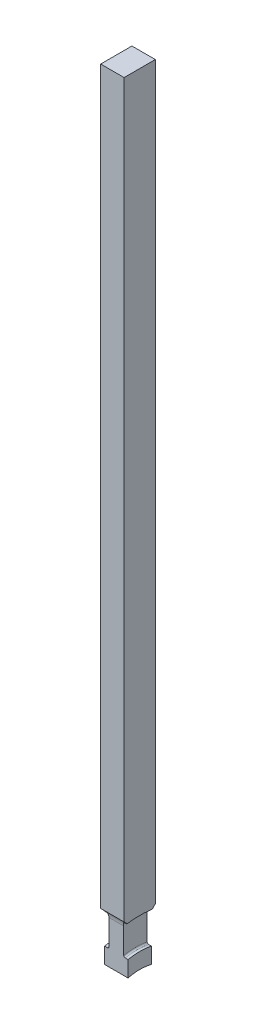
from build123d import *

# Parameters (mm, degrees)
SKETCH1_W               = 8
SKETCH1_H               = 212
BOSS_EXTRUDE1_DEPTH     = 3
CUT_EXTRUDE4_DEPTH      = 213.058954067
CUT_EXTRUDE4_DEPTH_BACK = 213.058954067
SKETCH8_R               = 12
SKETCH2_W               = 1.095
SKETCH2_H               = 8
CUT_EXTRUDE2_DEPTH      = 213.058954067
CUT_EXTRUDE2_DEPTH_BACK = 213.058954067
FILLET1_R               = 0.762
FILLET2_R               = 0.381


with BuildPart() as part:
    # Sketch1 → Boss-Extrude1 (new, symmetric)
    with BuildSketch(Plane(origin=(0, 0, 0), x_dir=(0, 0, -1), z_dir=(1, 0, 0))):
        with Locations((0, 106)):
            Rectangle(SKETCH1_W, SKETCH1_H)
    extrude(amount=BOSS_EXTRUDE1_DEPTH, both=True)

    # Sketch8 → Cut-Extrude4 (cut, two sides: drawn at the far end of the back side and taken through both)
    with BuildSketch(Plane(origin=(0, 0, 0), x_dir=(0, 0, -1), z_dir=(1, 0, 0)).offset(-CUT_EXTRUDE4_DEPTH_BACK)):
        Circle(SKETCH8_R)
    extrude(amount=CUT_EXTRUDE4_DEPTH + CUT_EXTRUDE4_DEPTH_BACK, mode=Mode.SUBTRACT)

    # Sketch2 → Cut-Revolve1 (revolve, cut)
    with BuildSketch(Plane.XY):
        with Locations((2.4525, 20)):
            Rectangle(SKETCH2_W, SKETCH2_H)
        with Locations((-2.4525, 20)):
            Rectangle(SKETCH2_W, SKETCH2_H)
    revolve(axis=Axis((-8.84822894, 0, 0), (1, 0, 0)), mode=Mode.SUBTRACT)

    # Sketch6 → Cut-Extrude2 (cut, two sides: drawn at the far end of the back side and taken through both)
    with BuildSketch(Plane(origin=(0, 0, 0), x_dir=(0, 0, -1), z_dir=(1, 0, 0)).offset(-CUT_EXTRUDE2_DEPTH_BACK)):
        with BuildLine():
            Line((3, 0), (22.05, 0))
            Line((22.05, 0), (22.05, 25))
            Line((22.05, 25), (5.3876, 25))
            ThreePointArc((5.3876, 25), (3.699311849, 24.300688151), (3, 22.6124))
            Line((3, 22.6124), (3, 0))
        make_face()
        with BuildLine():
            Line((-3, 0), (-22.05, 0))
            Line((-22.05, 0), (-22.05, 25))
            Line((-22.05, 25), (-5.3876, 25))
            ThreePointArc((-5.3876, 25), (-3.699311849, 24.300688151), (-3, 22.6124))
            Line((-3, 22.6124), (-3, 0))
        make_face()
    extrude(amount=CUT_EXTRUDE2_DEPTH + CUT_EXTRUDE2_DEPTH_BACK, mode=Mode.SUBTRACT)

    # Fillet1
    fillet1_edges = [part.edges().sort_by_distance(p)[0] for p in [
        (1.905, 24, 0),
        (-1.905, 24, 0),
    ]]
    fillet(fillet1_edges, radius=FILLET1_R)

    # Fillet2
    fillet2_edges = [part.edges().sort_by_distance(p)[0] for p in [
        (1.905, 16, 0),
        (-1.905, 16, 0),
    ]]
    fillet(fillet2_edges, radius=FILLET2_R)


solid = part.part
